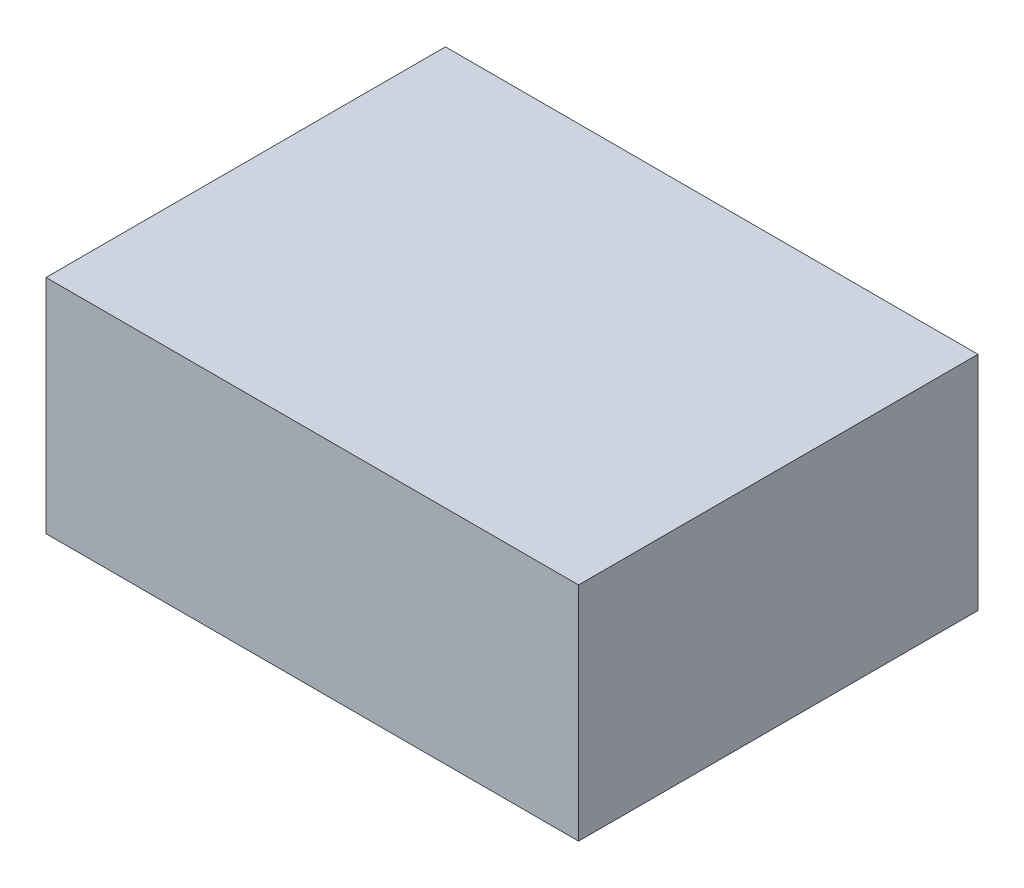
ISO-10303-21;
HEADER;
FILE_DESCRIPTION(('STEP AP214'),'2;1');
FILE_NAME('part.step','',(''),(''),'','','');
FILE_SCHEMA(('AUTOMOTIVE_DESIGN { 1 0 10303 214 1 1 1 1 }'));
ENDSEC;
DATA;
#1=APPLICATION_CONTEXT('core data for automotive mechanical design processes');
#2=APPLICATION_PROTOCOL_DEFINITION('international standard','automotive_design',2000,#1);
#3=PRODUCT_CONTEXT('',#1,'mechanical');
#4=PRODUCT('Part','Part','',(#3));
#5=PRODUCT_RELATED_PRODUCT_CATEGORY('part','',(#4));
#6=PRODUCT_DEFINITION_FORMATION('','',#4);
#7=PRODUCT_DEFINITION_CONTEXT('part definition',#1,'design');
#8=PRODUCT_DEFINITION('design','',#6,#7);
#9=PRODUCT_DEFINITION_SHAPE('','',#8);
#10=(LENGTH_UNIT() NAMED_UNIT(*) SI_UNIT(.MILLI.,.METRE.));
#11=(NAMED_UNIT(*) PLANE_ANGLE_UNIT() SI_UNIT($,.RADIAN.));
#12=(NAMED_UNIT(*) SI_UNIT($,.STERADIAN.) SOLID_ANGLE_UNIT());
#13=UNCERTAINTY_MEASURE_WITH_UNIT(LENGTH_MEASURE(1.E-05),#10,'distance_accuracy_value','');
#14=(GEOMETRIC_REPRESENTATION_CONTEXT(3) GLOBAL_UNCERTAINTY_ASSIGNED_CONTEXT((#13)) GLOBAL_UNIT_ASSIGNED_CONTEXT((#10,
#11,#12)) REPRESENTATION_CONTEXT('',''));
#15=CARTESIAN_POINT('',(0.,0.,0.));
#16=DIRECTION('',(0.,0.,1.));
#17=DIRECTION('',(1.,0.,0.));
#18=AXIS2_PLACEMENT_3D('',#15,#16,#17);
#19=CARTESIAN_POINT('',(152.4,127.,-114.3));
#20=DIRECTION('',(-1.,0.,0.));
#21=DIRECTION('',(0.,0.,1.));
#22=AXIS2_PLACEMENT_3D('',#19,#20,#21);
#23=PLANE('',#22);
#24=DIRECTION('',(0.,0.,-1.));
#25=VECTOR('',#24,1.);
#26=CARTESIAN_POINT('',(152.4,0.,-114.3));
#27=LINE('',#26,#25);
#28=CARTESIAN_POINT('',(152.4,0.,114.3));
#29=VERTEX_POINT('',#28);
#30=CARTESIAN_POINT('',(152.4,0.,-114.3));
#31=VERTEX_POINT('',#30);
#32=EDGE_CURVE('E96',#29,#31,#27,.T.);
#33=ORIENTED_EDGE('',*,*,#32,.T.);
#34=DIRECTION('',(0.,-1.,0.));
#35=VECTOR('',#34,1.);
#36=CARTESIAN_POINT('',(152.4,127.,-114.3));
#37=LINE('',#36,#35);
#38=CARTESIAN_POINT('',(152.4,127.,-114.3));
#39=VERTEX_POINT('',#38);
#40=EDGE_CURVE('E11',#39,#31,#37,.T.);
#41=ORIENTED_EDGE('',*,*,#40,.F.);
#42=DIRECTION('',(0.,0.,-1.));
#43=VECTOR('',#42,1.);
#44=CARTESIAN_POINT('',(152.4,127.,-114.3));
#45=LINE('',#44,#43);
#46=CARTESIAN_POINT('',(152.4,127.,114.3));
#47=VERTEX_POINT('',#46);
#48=EDGE_CURVE('E84',#47,#39,#45,.T.);
#49=ORIENTED_EDGE('',*,*,#48,.F.);
#50=DIRECTION('',(0.,-1.,0.));
#51=VECTOR('',#50,1.);
#52=CARTESIAN_POINT('',(152.4,127.,114.3));
#53=LINE('',#52,#51);
#54=EDGE_CURVE('E92',#47,#29,#53,.T.);
#55=ORIENTED_EDGE('',*,*,#54,.T.);
#56=EDGE_LOOP('',(#33,#41,#49,#55));
#57=FACE_BOUND('',#56,.T.);
#58=ADVANCED_FACE('F33',(#57),#23,.F.);
#59=CARTESIAN_POINT('',(-152.4,127.,-114.3));
#60=DIRECTION('',(0.,0.,1.));
#61=DIRECTION('',(1.,0.,0.));
#62=AXIS2_PLACEMENT_3D('',#59,#60,#61);
#63=PLANE('',#62);
#64=DIRECTION('',(-1.,0.,0.));
#65=VECTOR('',#64,1.);
#66=CARTESIAN_POINT('',(-152.4,0.,-114.3));
#67=LINE('',#66,#65);
#68=CARTESIAN_POINT('',(-152.4,0.,-114.3));
#69=VERTEX_POINT('',#68);
#70=EDGE_CURVE('E88',#31,#69,#67,.T.);
#71=ORIENTED_EDGE('',*,*,#70,.T.);
#72=DIRECTION('',(0.,-1.,0.));
#73=VECTOR('',#72,1.);
#74=CARTESIAN_POINT('',(-152.4,127.,-114.3));
#75=LINE('',#74,#73);
#76=CARTESIAN_POINT('',(-152.4,127.,-114.3));
#77=VERTEX_POINT('',#76);
#78=EDGE_CURVE('E41',#77,#69,#75,.T.);
#79=ORIENTED_EDGE('',*,*,#78,.F.);
#80=DIRECTION('',(-1.,0.,0.));
#81=VECTOR('',#80,1.);
#82=CARTESIAN_POINT('',(-152.4,127.,-114.3));
#83=LINE('',#82,#81);
#84=EDGE_CURVE('E79',#39,#77,#83,.T.);
#85=ORIENTED_EDGE('',*,*,#84,.F.);
#86=ORIENTED_EDGE('',*,*,#40,.T.);
#87=EDGE_LOOP('',(#71,#79,#85,#86));
#88=FACE_BOUND('',#87,.T.);
#89=ADVANCED_FACE('F87',(#88),#63,.F.);
#90=CARTESIAN_POINT('',(-152.4,127.,-114.3));
#91=DIRECTION('',(1.,0.,0.));
#92=DIRECTION('',(0.,0.,-1.));
#93=AXIS2_PLACEMENT_3D('',#90,#91,#92);
#94=PLANE('',#93);
#95=DIRECTION('',(0.,0.,1.));
#96=VECTOR('',#95,1.);
#97=CARTESIAN_POINT('',(-152.4,0.,-114.3));
#98=LINE('',#97,#96);
#99=CARTESIAN_POINT('',(-152.4,0.,114.3));
#100=VERTEX_POINT('',#99);
#101=EDGE_CURVE('E66',#69,#100,#98,.T.);
#102=ORIENTED_EDGE('',*,*,#101,.T.);
#103=DIRECTION('',(0.,-1.,0.));
#104=VECTOR('',#103,1.);
#105=CARTESIAN_POINT('',(-152.4,127.,114.3));
#106=LINE('',#105,#104);
#107=CARTESIAN_POINT('',(-152.4,127.,114.3));
#108=VERTEX_POINT('',#107);
#109=EDGE_CURVE('E89',#108,#100,#106,.T.);
#110=ORIENTED_EDGE('',*,*,#109,.F.);
#111=DIRECTION('',(0.,0.,1.));
#112=VECTOR('',#111,1.);
#113=CARTESIAN_POINT('',(-152.4,127.,-114.3));
#114=LINE('',#113,#112);
#115=EDGE_CURVE('E82',#77,#108,#114,.T.);
#116=ORIENTED_EDGE('',*,*,#115,.F.);
#117=ORIENTED_EDGE('',*,*,#78,.T.);
#118=EDGE_LOOP('',(#102,#110,#116,#117));
#119=FACE_BOUND('',#118,.T.);
#120=ADVANCED_FACE('F90',(#119),#94,.F.);
#121=CARTESIAN_POINT('',(-152.4,127.,114.3));
#122=DIRECTION('',(0.,0.,-1.));
#123=DIRECTION('',(-1.,0.,0.));
#124=AXIS2_PLACEMENT_3D('',#121,#122,#123);
#125=PLANE('',#124);
#126=DIRECTION('',(1.,0.,0.));
#127=VECTOR('',#126,1.);
#128=CARTESIAN_POINT('',(-152.4,0.,114.3));
#129=LINE('',#128,#127);
#130=EDGE_CURVE('E72',#100,#29,#129,.T.);
#131=ORIENTED_EDGE('',*,*,#130,.T.);
#132=ORIENTED_EDGE('',*,*,#54,.F.);
#133=DIRECTION('',(1.,0.,0.));
#134=VECTOR('',#133,1.);
#135=CARTESIAN_POINT('',(-152.4,127.,114.3));
#136=LINE('',#135,#134);
#137=EDGE_CURVE('E49',#108,#47,#136,.T.);
#138=ORIENTED_EDGE('',*,*,#137,.F.);
#139=ORIENTED_EDGE('',*,*,#109,.T.);
#140=EDGE_LOOP('',(#131,#132,#138,#139));
#141=FACE_BOUND('',#140,.T.);
#142=ADVANCED_FACE('F103',(#141),#125,.F.);
#143=CARTESIAN_POINT('',(0.,127.,0.));
#144=DIRECTION('',(0.,1.,0.));
#145=DIRECTION('',(0.,0.,1.));
#146=AXIS2_PLACEMENT_3D('',#143,#144,#145);
#147=PLANE('',#146);
#148=ORIENTED_EDGE('',*,*,#48,.T.);
#149=ORIENTED_EDGE('',*,*,#84,.T.);
#150=ORIENTED_EDGE('',*,*,#115,.T.);
#151=ORIENTED_EDGE('',*,*,#137,.T.);
#152=EDGE_LOOP('',(#148,#149,#150,#151));
#153=FACE_BOUND('',#152,.T.);
#154=ADVANCED_FACE('F80',(#153),#147,.T.);
#155=CARTESIAN_POINT('',(0.,0.,0.));
#156=DIRECTION('',(0.,1.,0.));
#157=DIRECTION('',(0.,0.,1.));
#158=AXIS2_PLACEMENT_3D('',#155,#156,#157);
#159=PLANE('',#158);
#160=ORIENTED_EDGE('',*,*,#32,.F.);
#161=ORIENTED_EDGE('',*,*,#130,.F.);
#162=ORIENTED_EDGE('',*,*,#101,.F.);
#163=ORIENTED_EDGE('',*,*,#70,.F.);
#164=EDGE_LOOP('',(#160,#161,#162,#163));
#165=FACE_BOUND('',#164,.T.);
#166=ADVANCED_FACE('F106',(#165),#159,.F.);
#167=CLOSED_SHELL('',(#58,#89,#120,#142,#154,#166));
#168=MANIFOLD_SOLID_BREP('B2',#167);
#169=ADVANCED_BREP_SHAPE_REPRESENTATION('',(#18,#168),#14);
#170=SHAPE_DEFINITION_REPRESENTATION(#9,#169);
ENDSEC;
END-ISO-10303-21;
